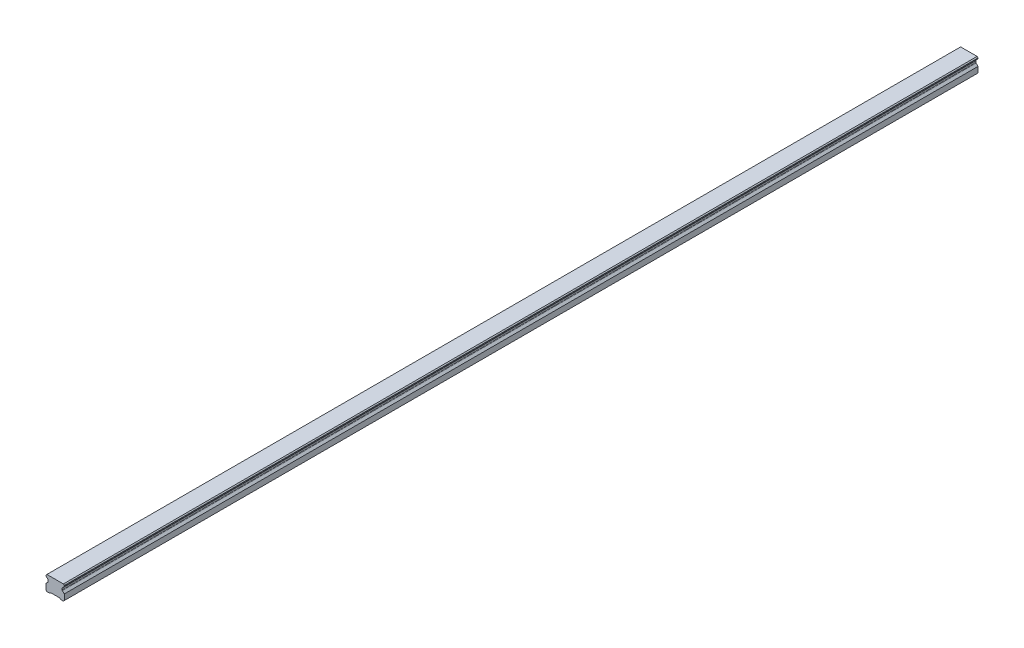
from build123d import *

# Parameters (mm, degrees)
SKETCH1_W           = 20
SKETCH1_H           = 16.3
BOSS_EXTRUDE1_DEPTH = 500
CUT_EXTRUDE1_DEPTH  = 1001.182828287
CHAMFER1_SIZE       = 1
FILLET1_R           = 1
CUT_EXTRUDE2_DEPTH  = 1001.182828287
SKETCH5_R           = 3
SKETCH5_R_2         = 2.5
CUT_EXTRUDE5_DEPTH  = 10
SKETCH5_2_R         = 2.5
CUT_EXTRUDE6_DEPTH  = 13
LPATTERN2_COUNT     = 17
LPATTERN2_PITCH     = 60


with BuildPart() as part:
    # Sketch1 → Boss-Extrude1 (new, symmetric)
    with BuildSketch(Plane.XY):
        with Locations((0, 8.15)):
            Rectangle(SKETCH1_W, SKETCH1_H)
    extrude(amount=BOSS_EXTRUDE1_DEPTH, both=True)

    # Sketch2 → Cut-Extrude1 (cut, through all)
    with BuildSketch(Plane.XY.offset(500)):
        Polygon((-10, 14.3), (-10, 7.3), (-7.666666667, 9.633333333), (-7.666666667, 11.966666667), align=None)
        Polygon((7.666666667, 11.966666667), (10, 14.3), (10, 7.3), (7.666666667, 9.633333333), align=None)
    extrude(amount=-CUT_EXTRUDE1_DEPTH, mode=Mode.SUBTRACT)

    # Chamfer1
    chamfer1_edges = [part.edges().sort_by_distance(p)[0] for p in [
        (-10, 16.3, 0),
        (10, 16.3, 0),
        (10, 0, 0),
        (-10, 0, 0),
    ]]
    chamfer(chamfer1_edges, length=CHAMFER1_SIZE)

    # Fillet1
    fillet1_edges = [part.edges().sort_by_distance(p)[0] for p in [
        (-7.666666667, 11.966666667, 0),
        (-7.666666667, 9.633333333, 0),
        (7.666666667, 9.633333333, 0),
        (7.666666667, 11.966666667, 0),
    ]]
    fillet(fillet1_edges, radius=FILLET1_R)

    # Sketch3 → Cut-Extrude2 (cut, through all)
    with BuildSketch(Plane.XY.offset(500)):
        Polygon((-6, 0), (-5, 1), (5, 1), (6, 0), align=None)
    extrude(amount=-CUT_EXTRUDE2_DEPTH, mode=Mode.SUBTRACT)

    # Sketch5 → Cut-Extrude5 (cut)
    with BuildSketch(Plane.XZ.offset(-1)):
        with Locations(Location((0, 480, 0), (0, 0, 270))):
            Circle(SKETCH5_R)
        with Locations(Location((0, 480, 0), (0, 0, 270))):
            Circle(SKETCH5_R_2, mode=Mode.SUBTRACT)
    cut_extrude5 = extrude(amount=-CUT_EXTRUDE5_DEPTH, mode=Mode.SUBTRACT)

    # Sketch5_2 → Cut-Extrude6 (cut)
    with BuildSketch(Plane.XZ.offset(-1)):
        with Locations(Location((0, 480, 0), (0, 0, 270))):
            Circle(SKETCH5_2_R)
    cut_extrude6 = extrude(amount=-CUT_EXTRUDE6_DEPTH, mode=Mode.SUBTRACT)

    # Cut-Extrude7 cone 1 section (on through the dimple's axis) → Cut-Extrude7 (revolve, cut)
    with BuildSketch(Plane(origin=(0, 14, 480), x_dir=(0, 0, -1), z_dir=(1, 0, 0))):
        Polygon((0, 0), (2.5, 0), (0, 1.443375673), align=None)
    cut_extrude7 = revolve(axis=Axis((0, 14, 480), (0, 1, 0)), mode=Mode.SUBTRACT)

    # LPattern2: Cut-Extrude5, Cut-Extrude6, Cut-Extrude7 ×17
    with Locations(*[(0, 0, -i * LPATTERN2_PITCH) for i in range(1, LPATTERN2_COUNT)]):
        add(cut_extrude5, mode=Mode.SUBTRACT)
        add(cut_extrude6, mode=Mode.SUBTRACT)
        add(cut_extrude7, mode=Mode.SUBTRACT)


solid = part.part
